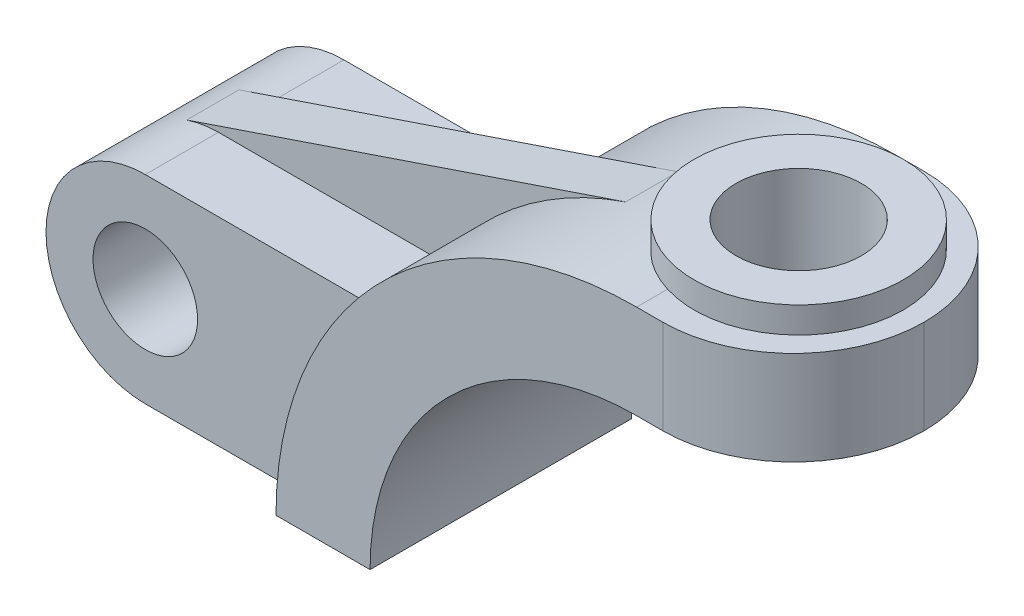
ISO-10303-21;
HEADER;
FILE_DESCRIPTION(('STEP AP214'),'2;1');
FILE_NAME('part.step','',(''),(''),'','','');
FILE_SCHEMA(('AUTOMOTIVE_DESIGN { 1 0 10303 214 1 1 1 1 }'));
ENDSEC;
DATA;
#1=APPLICATION_CONTEXT('core data for automotive mechanical design processes');
#2=APPLICATION_PROTOCOL_DEFINITION('international standard','automotive_design',2000,#1);
#3=PRODUCT_CONTEXT('',#1,'mechanical');
#4=PRODUCT('Part','Part','',(#3));
#5=PRODUCT_RELATED_PRODUCT_CATEGORY('part','',(#4));
#6=PRODUCT_DEFINITION_FORMATION('','',#4);
#7=PRODUCT_DEFINITION_CONTEXT('part definition',#1,'design');
#8=PRODUCT_DEFINITION('design','',#6,#7);
#9=PRODUCT_DEFINITION_SHAPE('','',#8);
#10=(LENGTH_UNIT() NAMED_UNIT(*) SI_UNIT(.MILLI.,.METRE.));
#11=(NAMED_UNIT(*) PLANE_ANGLE_UNIT() SI_UNIT($,.RADIAN.));
#12=(NAMED_UNIT(*) SI_UNIT($,.STERADIAN.) SOLID_ANGLE_UNIT());
#13=UNCERTAINTY_MEASURE_WITH_UNIT(LENGTH_MEASURE(1.E-05),#10,'distance_accuracy_value','');
#14=(GEOMETRIC_REPRESENTATION_CONTEXT(3) GLOBAL_UNCERTAINTY_ASSIGNED_CONTEXT((#13)) GLOBAL_UNIT_ASSIGNED_CONTEXT((#10,
#11,#12)) REPRESENTATION_CONTEXT('',''));
#15=CARTESIAN_POINT('',(0.,0.,0.));
#16=DIRECTION('',(0.,0.,1.));
#17=DIRECTION('',(1.,0.,0.));
#18=AXIS2_PLACEMENT_3D('',#15,#16,#17);
#19=CARTESIAN_POINT('',(0.,0.,-25.));
#20=DIRECTION('',(0.,0.,1.));
#21=DIRECTION('',(1.,0.,0.));
#22=AXIS2_PLACEMENT_3D('',#19,#20,#21);
#23=CYLINDRICAL_SURFACE('',#22,69.);
#24=DIRECTION('',(0.,0.,1.));
#25=VECTOR('',#24,1.);
#26=CARTESIAN_POINT('',(0.,69.,-25.));
#27=LINE('',#26,#25);
#28=CARTESIAN_POINT('',(0.,69.,19.0787840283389));
#29=VERTEX_POINT('',#28);
#30=CARTESIAN_POINT('',(0.,69.,25.));
#31=VERTEX_POINT('',#30);
#32=EDGE_CURVE('E203',#29,#31,#27,.T.);
#33=ORIENTED_EDGE('',*,*,#32,.F.);
#34=CARTESIAN_POINT('',(0.,69.,19.0787840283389));
#35=CARTESIAN_POINT('',(-0.265552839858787,69.0000019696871,18.9952724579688));
#36=CARTESIAN_POINT('',(-0.52932949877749,68.9984666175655,18.9062242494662));
#37=CARTESIAN_POINT('',(-1.05289731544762,68.9924626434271,18.7172141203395));
#38=CARTESIAN_POINT('',(-1.31268863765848,68.9879941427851,18.6172526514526));
#39=CARTESIAN_POINT('',(-2.08524848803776,68.9704057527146,18.3013162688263));
#40=CARTESIAN_POINT('',(-2.59142960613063,68.9531027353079,18.0692180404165));
#41=CARTESIAN_POINT('',(-3.58150813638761,68.9087659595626,17.5642540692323));
#42=CARTESIAN_POINT('',(-4.06544115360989,68.8817484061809,17.2914566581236));
#43=CARTESIAN_POINT('',(-4.77267358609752,68.8351472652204,16.8530856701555));
#44=CARTESIAN_POINT('',(-5.00532086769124,68.8185998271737,16.7020889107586));
#45=CARTESIAN_POINT('',(-5.46410264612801,68.783693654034,16.3905840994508));
#46=CARTESIAN_POINT('',(-5.69023552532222,68.7653344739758,16.2300737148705));
#47=CARTESIAN_POINT('',(-6.35798909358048,68.707899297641,15.7348986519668));
#48=CARTESIAN_POINT('',(-6.78926192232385,68.6664455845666,15.3864057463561));
#49=CARTESIAN_POINT('',(-7.62114489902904,68.5791014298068,14.6550724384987));
#50=CARTESIAN_POINT('',(-8.02175457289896,68.5332109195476,14.2722315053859));
#51=CARTESIAN_POINT('',(-8.59770640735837,68.4625219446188,13.6741968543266));
#52=CARTESIAN_POINT('',(-8.78557577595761,68.4386435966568,13.4708334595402));
#53=CARTESIAN_POINT('',(-9.15264612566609,68.3905206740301,13.0565650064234));
#54=CARTESIAN_POINT('',(-9.33184929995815,68.3662761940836,12.8456618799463));
#55=CARTESIAN_POINT('',(-9.85611683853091,68.2933487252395,12.202036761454));
#56=CARTESIAN_POINT('',(-10.1878688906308,68.2444680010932,11.7583682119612));
#57=CARTESIAN_POINT('',(-10.8187502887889,68.1473278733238,10.8372769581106));
#58=CARTESIAN_POINT('',(-11.1172342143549,68.0990928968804,10.3594108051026));
#59=CARTESIAN_POINT('',(-11.6729725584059,68.0060373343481,9.37992841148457));
#60=CARTESIAN_POINT('',(-11.930226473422,67.9612167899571,8.87831188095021));
#61=CARTESIAN_POINT('',(-12.4016266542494,67.8767783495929,7.85478252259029));
#62=CARTESIAN_POINT('',(-12.6157722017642,67.8371605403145,7.33286935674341));
#63=CARTESIAN_POINT('',(-12.9993398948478,67.7647053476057,6.27239954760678));
#64=CARTESIAN_POINT('',(-13.1687625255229,67.7318678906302,5.73384308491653));
#65=CARTESIAN_POINT('',(-13.460886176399,67.6744163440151,4.64643860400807));
#66=CARTESIAN_POINT('',(-13.5837988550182,67.6497650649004,4.0976494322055));
#67=CARTESIAN_POINT('',(-13.7830166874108,67.6094579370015,2.99134443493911));
#68=CARTESIAN_POINT('',(-13.8593219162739,67.5938020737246,2.43382862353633));
#69=CARTESIAN_POINT('',(-13.9646898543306,67.5721121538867,1.31424908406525));
#70=CARTESIAN_POINT('',(-13.9937598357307,67.5660766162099,0.752186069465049));
#71=CARTESIAN_POINT('',(-14.0044372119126,67.5638644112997,-0.372405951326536));
#72=CARTESIAN_POINT('',(-13.9860452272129,67.5676876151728,-0.934934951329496));
#73=CARTESIAN_POINT('',(-13.9027266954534,67.5848795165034,-2.0460011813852));
#74=CARTESIAN_POINT('',(-13.8386595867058,67.598071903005,-2.59460583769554));
#75=CARTESIAN_POINT('',(-13.6654496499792,67.6333001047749,-3.68435533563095));
#76=CARTESIAN_POINT('',(-13.5563073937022,67.6553358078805,-4.22550027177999));
#77=CARTESIAN_POINT('',(-13.2937882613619,67.7074078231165,-5.29658288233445));
#78=CARTESIAN_POINT('',(-13.1404090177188,67.7374445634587,-5.82651995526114));
#79=CARTESIAN_POINT('',(-12.7905744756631,67.8043722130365,-6.87153073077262));
#80=CARTESIAN_POINT('',(-12.5941187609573,67.8412631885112,-7.38660428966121));
#81=CARTESIAN_POINT('',(-12.1583777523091,67.9207120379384,-8.401176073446));
#82=CARTESIAN_POINT('',(-11.9188662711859,67.9632995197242,-8.90057484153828));
#83=CARTESIAN_POINT('',(-11.3994469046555,68.0523476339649,-9.87751756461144));
#84=CARTESIAN_POINT('',(-11.1195387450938,68.0988082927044,-10.3550613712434));
#85=CARTESIAN_POINT('',(-10.521101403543,68.1938279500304,-11.2853482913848));
#86=CARTESIAN_POINT('',(-10.2025618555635,68.2423875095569,-11.7380847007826));
#87=CARTESIAN_POINT('',(-9.69756356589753,68.3153436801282,-12.3960883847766));
#88=CARTESIAN_POINT('',(-9.52469214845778,68.3396828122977,-12.6119140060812));
#89=CARTESIAN_POINT('',(-9.1700945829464,68.3881671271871,-13.0362841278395));
#90=CARTESIAN_POINT('',(-8.98836614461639,68.4123122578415,-13.2448267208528));
#91=CARTESIAN_POINT('',(-8.423377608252,68.4849813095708,-13.866639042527));
#92=CARTESIAN_POINT('',(-8.02662297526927,68.5328110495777,-14.26786138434));
#93=CARTESIAN_POINT('',(-7.20038075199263,68.624537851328,-15.0355559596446));
#94=CARTESIAN_POINT('',(-6.77089324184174,68.6684349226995,-15.402028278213));
#95=CARTESIAN_POINT('',(-6.10458046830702,68.7297887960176,-15.9235260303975));
#96=CARTESIAN_POINT('',(-5.87885237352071,68.7494873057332,-16.0926198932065));
#97=CARTESIAN_POINT('',(-5.42041384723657,68.7871499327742,-16.4211340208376));
#98=CARTESIAN_POINT('',(-5.18770532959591,68.8051145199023,-16.5805569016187));
#99=CARTESIAN_POINT('',(-4.47975043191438,68.8560495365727,-17.0438499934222));
#100=CARTESIAN_POINT('',(-3.99448494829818,68.886079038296,-17.3328931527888));
#101=CARTESIAN_POINT('',(-2.93982924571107,68.9396041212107,-17.9019830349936));
#102=CARTESIAN_POINT('',(-2.36741917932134,68.9618473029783,-18.1765824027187));
#103=CARTESIAN_POINT('',(-1.49155450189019,68.9844955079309,-18.5466180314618));
#104=CARTESIAN_POINT('',(-1.19689306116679,68.9902585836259,-18.6629330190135));
#105=CARTESIAN_POINT('',(-0.602259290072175,68.9980128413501,-18.8814859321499));
#106=CARTESIAN_POINT('',(-0.302285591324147,69.0000030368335,-18.9837201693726));
#107=CARTESIAN_POINT('',(0.,69.,-19.0787840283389));
#108=B_SPLINE_CURVE_WITH_KNOTS('',3,(#34,#35,#36,#37,#38,#39,#40,#41,#42,#43,#44,#45,#46,#47,
#48,#49,#50,#51,#52,#53,#54,#55,#56,#57,#58,#59,#60,#61,#62,#63,#64,#65,#66,#67,#68,#69,#70,#71,
#72,#73,#74,#75,#76,#77,#78,#79,#80,#81,#82,#83,#84,#85,#86,#87,#88,#89,#90,#91,#92,#93,#94,#95,
#96,#97,#98,#99,#100,#101,#102,#103,#104,#105,#106,#107),.UNSPECIFIED.,.F.,.F.,(4,2,2,2,2,2,2,2,
2,2,2,2,2,2,2,2,2,2,2,2,2,2,2,2,2,2,2,2,2,2,2,2,2,2,2,2,4),(0.,0.834993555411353,
1.66995256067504,3.33915998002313,5.00559579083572,5.8389205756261,6.67245053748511,
8.3384629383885,10.0045010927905,10.8379562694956,11.6711994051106,13.3375572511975,
15.0320516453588,16.7265667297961,18.4211100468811,20.1156349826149,21.8023529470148,
23.4890681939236,25.1755237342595,26.8619572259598,28.5174683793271,30.1729585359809,
31.8285373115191,33.4841320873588,35.1486929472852,36.81326510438,38.4782849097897,
39.3108587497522,40.1436490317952,41.8403687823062,43.5370843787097,44.3850381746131,
45.2327615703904,46.9274859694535,48.8299804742,49.7801731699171,50.7306142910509),.UNSPECIFIED.);
#109=CARTESIAN_POINT('',(0.,69.,-19.0787840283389));
#110=VERTEX_POINT('',#109);
#111=EDGE_CURVE('E223',#29,#110,#108,.T.);
#112=ORIENTED_EDGE('',*,*,#111,.T.);
#113=CARTESIAN_POINT('',(0.,69.,-25.));
#114=VERTEX_POINT('',#113);
#115=EDGE_CURVE('E200',#114,#110,#27,.T.);
#116=ORIENTED_EDGE('',*,*,#115,.F.);
#117=CARTESIAN_POINT('',(0.,0.,-25.));
#118=DIRECTION('',(0.,0.,1.));
#119=DIRECTION('',(1.,0.,0.));
#120=AXIS2_PLACEMENT_3D('',#117,#118,#119);
#121=CIRCLE('',#120,69.);
#122=CARTESIAN_POINT('',(-69.,0.,-25.));
#123=VERTEX_POINT('',#122);
#124=EDGE_CURVE('E341',#114,#123,#121,.T.);
#125=ORIENTED_EDGE('',*,*,#124,.T.);
#126=DIRECTION('',(0.,0.,1.));
#127=VECTOR('',#126,1.);
#128=CARTESIAN_POINT('',(-69.,0.,-25.));
#129=LINE('',#128,#127);
#130=CARTESIAN_POINT('',(-69.,0.,-19.));
#131=VERTEX_POINT('',#130);
#132=EDGE_CURVE('E190',#123,#131,#129,.T.);
#133=ORIENTED_EDGE('',*,*,#132,.T.);
#134=CARTESIAN_POINT('',(0.,0.,-19.));
#135=DIRECTION('',(0.,0.,1.));
#136=DIRECTION('',(1.,0.,0.));
#137=AXIS2_PLACEMENT_3D('',#134,#135,#136);
#138=CIRCLE('',#137,69.);
#139=CARTESIAN_POINT('',(-57.6197952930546,37.9599682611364,-19.));
#140=VERTEX_POINT('',#139);
#141=EDGE_CURVE('E375',#140,#131,#138,.T.);
#142=ORIENTED_EDGE('',*,*,#141,.F.);
#143=DIRECTION('',(0.,0.,1.));
#144=VECTOR('',#143,1.);
#145=CARTESIAN_POINT('',(-57.6197952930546,37.9599682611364,-19.));
#146=LINE('',#145,#144);
#147=CARTESIAN_POINT('',(-57.6197952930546,37.9599682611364,-5.));
#148=VERTEX_POINT('',#147);
#149=EDGE_CURVE('E364',#140,#148,#146,.T.);
#150=ORIENTED_EDGE('',*,*,#149,.T.);
#151=CARTESIAN_POINT('',(0.,0.,-5.));
#152=DIRECTION('',(0.,0.,1.));
#153=DIRECTION('',(1.,0.,0.));
#154=AXIS2_PLACEMENT_3D('',#151,#152,#153);
#155=CIRCLE('',#154,69.);
#156=CARTESIAN_POINT('',(-22.1072732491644,65.3625922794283,-5.));
#157=VERTEX_POINT('',#156);
#158=EDGE_CURVE('E425',#157,#148,#155,.T.);
#159=ORIENTED_EDGE('',*,*,#158,.F.);
#160=DIRECTION('',(0.,0.,1.));
#161=VECTOR('',#160,1.);
#162=CARTESIAN_POINT('',(-22.1072732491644,65.3625922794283,-5.));
#163=LINE('',#162,#161);
#164=CARTESIAN_POINT('',(-22.1072732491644,65.3625922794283,5.));
#165=VERTEX_POINT('',#164);
#166=EDGE_CURVE('E415',#157,#165,#163,.T.);
#167=ORIENTED_EDGE('',*,*,#166,.T.);
#168=CARTESIAN_POINT('',(0.,0.,5.));
#169=DIRECTION('',(0.,0.,1.));
#170=DIRECTION('',(1.,0.,0.));
#171=AXIS2_PLACEMENT_3D('',#168,#169,#170);
#172=CIRCLE('',#171,69.);
#173=CARTESIAN_POINT('',(-57.6197952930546,37.9599682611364,5.));
#174=VERTEX_POINT('',#173);
#175=EDGE_CURVE('E440',#165,#174,#172,.T.);
#176=ORIENTED_EDGE('',*,*,#175,.T.);
#177=CARTESIAN_POINT('',(-57.6197952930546,37.9599682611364,19.));
#178=VERTEX_POINT('',#177);
#179=EDGE_CURVE('E362',#174,#178,#146,.T.);
#180=ORIENTED_EDGE('',*,*,#179,.T.);
#181=CARTESIAN_POINT('',(0.,0.,19.));
#182=DIRECTION('',(0.,0.,1.));
#183=DIRECTION('',(1.,0.,0.));
#184=AXIS2_PLACEMENT_3D('',#181,#182,#183);
#185=CIRCLE('',#184,69.);
#186=CARTESIAN_POINT('',(-69.,0.,19.));
#187=VERTEX_POINT('',#186);
#188=EDGE_CURVE('E387',#178,#187,#185,.T.);
#189=ORIENTED_EDGE('',*,*,#188,.T.);
#190=CARTESIAN_POINT('',(-69.,0.,25.));
#191=VERTEX_POINT('',#190);
#192=EDGE_CURVE('E199',#187,#191,#129,.T.);
#193=ORIENTED_EDGE('',*,*,#192,.T.);
#194=CARTESIAN_POINT('',(0.,0.,25.));
#195=DIRECTION('',(0.,0.,1.));
#196=DIRECTION('',(1.,0.,0.));
#197=AXIS2_PLACEMENT_3D('',#194,#195,#196);
#198=CIRCLE('',#197,69.);
#199=EDGE_CURVE('E330',#31,#191,#198,.T.);
#200=ORIENTED_EDGE('',*,*,#199,.F.);
#201=EDGE_LOOP('',(#33,#112,#116,#125,#133,#142,#150,#159,#167,#176,#180,#189,#193,#200));
#202=FACE_BOUND('',#201,.T.);
#203=ADVANCED_FACE('F46',(#202),#23,.T.);
#204=CARTESIAN_POINT('',(0.,37.9599682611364,-19.));
#205=DIRECTION('',(0.,-1.,0.));
#206=DIRECTION('',(0.,0.,-1.));
#207=AXIS2_PLACEMENT_3D('',#204,#205,#206);
#208=PLANE('',#207);
#209=DIRECTION('',(1.,0.,0.));
#210=VECTOR('',#209,1.);
#211=CARTESIAN_POINT('',(0.,37.9599682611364,-5.));
#212=LINE('',#211,#210);
#213=CARTESIAN_POINT('',(-100.,37.9599682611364,-5.));
#214=VERTEX_POINT('',#213);
#215=EDGE_CURVE('E429',#214,#148,#212,.T.);
#216=ORIENTED_EDGE('',*,*,#215,.T.);
#217=ORIENTED_EDGE('',*,*,#149,.F.);
#218=DIRECTION('',(1.,0.,0.));
#219=VECTOR('',#218,1.);
#220=CARTESIAN_POINT('',(0.,37.9599682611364,-19.));
#221=LINE('',#220,#219);
#222=CARTESIAN_POINT('',(-100.,37.9599682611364,-19.));
#223=VERTEX_POINT('',#222);
#224=EDGE_CURVE('E363',#223,#140,#221,.T.);
#225=ORIENTED_EDGE('',*,*,#224,.F.);
#226=DIRECTION('',(0.,0.,1.));
#227=VECTOR('',#226,1.);
#228=CARTESIAN_POINT('',(-100.,37.9599682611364,-19.));
#229=LINE('',#228,#227);
#230=EDGE_CURVE('E357',#223,#214,#229,.T.);
#231=ORIENTED_EDGE('',*,*,#230,.T.);
#232=EDGE_LOOP('',(#216,#217,#225,#231));
#233=FACE_BOUND('',#232,.T.);
#234=ADVANCED_FACE('F278',(#233),#208,.F.);
#235=CARTESIAN_POINT('',(-100.,18.9599682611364,-19.));
#236=DIRECTION('',(0.,0.,1.));
#237=DIRECTION('',(1.,0.,0.));
#238=AXIS2_PLACEMENT_3D('',#235,#236,#237);
#239=CYLINDRICAL_SURFACE('',#238,19.);
#240=DIRECTION('',(0.,0.,1.));
#241=VECTOR('',#240,1.);
#242=CARTESIAN_POINT('',(-106.087510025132,36.9583632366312,-5.));
#243=LINE('',#242,#241);
#244=CARTESIAN_POINT('',(-106.087510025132,36.9583632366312,-5.));
#245=VERTEX_POINT('',#244);
#246=CARTESIAN_POINT('',(-106.087510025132,36.9583632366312,5.));
#247=VERTEX_POINT('',#246);
#248=EDGE_CURVE('E414',#245,#247,#243,.T.);
#249=ORIENTED_EDGE('',*,*,#248,.F.);
#250=CARTESIAN_POINT('',(-100.,18.9599682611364,-5.));
#251=DIRECTION('',(0.,0.,1.));
#252=DIRECTION('',(1.,0.,0.));
#253=AXIS2_PLACEMENT_3D('',#250,#251,#252);
#254=CIRCLE('',#253,19.);
#255=EDGE_CURVE('E432',#214,#245,#254,.T.);
#256=ORIENTED_EDGE('',*,*,#255,.F.);
#257=ORIENTED_EDGE('',*,*,#230,.F.);
#258=CARTESIAN_POINT('',(-100.,18.9599682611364,-19.));
#259=DIRECTION('',(0.,0.,1.));
#260=DIRECTION('',(1.,0.,0.));
#261=AXIS2_PLACEMENT_3D('',#258,#259,#260);
#262=CIRCLE('',#261,19.);
#263=CARTESIAN_POINT('',(-100.,-0.0400317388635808,-19.));
#264=VERTEX_POINT('',#263);
#265=EDGE_CURVE('E398',#223,#264,#262,.T.);
#266=ORIENTED_EDGE('',*,*,#265,.T.);
#267=DIRECTION('',(0.,0.,1.));
#268=VECTOR('',#267,1.);
#269=CARTESIAN_POINT('',(-100.,-0.0400317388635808,-19.));
#270=LINE('',#269,#268);
#271=CARTESIAN_POINT('',(-100.,-0.0400317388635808,19.));
#272=VERTEX_POINT('',#271);
#273=EDGE_CURVE('E394',#264,#272,#270,.T.);
#274=ORIENTED_EDGE('',*,*,#273,.T.);
#275=CARTESIAN_POINT('',(-100.,18.9599682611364,19.));
#276=DIRECTION('',(0.,0.,1.));
#277=DIRECTION('',(1.,0.,0.));
#278=AXIS2_PLACEMENT_3D('',#275,#276,#277);
#279=CIRCLE('',#278,19.);
#280=CARTESIAN_POINT('',(-100.,37.9599682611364,19.));
#281=VERTEX_POINT('',#280);
#282=EDGE_CURVE('E406',#281,#272,#279,.T.);
#283=ORIENTED_EDGE('',*,*,#282,.F.);
#284=CARTESIAN_POINT('',(-100.,37.9599682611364,5.));
#285=VERTEX_POINT('',#284);
#286=EDGE_CURVE('E368',#285,#281,#229,.T.);
#287=ORIENTED_EDGE('',*,*,#286,.F.);
#288=CARTESIAN_POINT('',(-100.,18.9599682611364,5.));
#289=DIRECTION('',(0.,0.,1.));
#290=DIRECTION('',(1.,0.,0.));
#291=AXIS2_PLACEMENT_3D('',#288,#289,#290);
#292=CIRCLE('',#291,19.);
#293=EDGE_CURVE('E447',#285,#247,#292,.T.);
#294=ORIENTED_EDGE('',*,*,#293,.T.);
#295=EDGE_LOOP('',(#249,#256,#257,#266,#274,#283,#287,#294));
#296=FACE_BOUND('',#295,.T.);
#297=ADVANCED_FACE('F275',(#296),#239,.T.);
#298=CARTESIAN_POINT('',(0.,0.,-25.));
#299=DIRECTION('',(0.,0.,1.));
#300=DIRECTION('',(1.,0.,0.));
#301=AXIS2_PLACEMENT_3D('',#298,#299,#300);
#302=CYLINDRICAL_SURFACE('',#301,51.);
#303=DIRECTION('',(0.,0.,1.));
#304=VECTOR('',#303,1.);
#305=CARTESIAN_POINT('',(0.,51.,-25.));
#306=LINE('',#305,#304);
#307=CARTESIAN_POINT('',(0.,51.,-25.));
#308=VERTEX_POINT('',#307);
#309=CARTESIAN_POINT('',(0.,51.,-10.3923048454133));
#310=VERTEX_POINT('',#309);
#311=EDGE_CURVE('E176',#308,#310,#306,.T.);
#312=ORIENTED_EDGE('',*,*,#311,.T.);
#313=CARTESIAN_POINT('',(0.,51.,-10.3923048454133));
#314=CARTESIAN_POINT('',(-0.291487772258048,51.0000140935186,-10.2240581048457));
#315=CARTESIAN_POINT('',(-0.575843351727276,50.9975011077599,-10.0434940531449));
#316=CARTESIAN_POINT('',(-1.12831695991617,50.9882618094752,-9.65919587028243));
#317=CARTESIAN_POINT('',(-1.3964370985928,50.9815360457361,-9.45546475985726));
#318=CARTESIAN_POINT('',(-1.9143010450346,50.9647194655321,-9.02645336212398));
#319=CARTESIAN_POINT('',(-2.16406182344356,50.9546318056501,-8.80119342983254));
#320=CARTESIAN_POINT('',(-2.64374959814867,50.9319961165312,-8.33057458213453));
#321=CARTESIAN_POINT('',(-2.8736763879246,50.9194480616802,-8.08521545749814));
#322=CARTESIAN_POINT('',(-3.31213102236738,50.8928094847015,-7.57608745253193));
#323=CARTESIAN_POINT('',(-3.52065577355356,50.8787187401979,-7.31231592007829));
#324=CARTESIAN_POINT('',(-3.91483039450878,50.8499082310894,-6.76823369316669));
#325=CARTESIAN_POINT('',(-4.10048020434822,50.8351884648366,-6.48792295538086));
#326=CARTESIAN_POINT('',(-4.44760159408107,50.8059955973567,-5.91273567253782));
#327=CARTESIAN_POINT('',(-4.60907554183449,50.791522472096,-5.61786055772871));
#328=CARTESIAN_POINT('',(-4.90673867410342,50.7636314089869,-5.01556497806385));
#329=CARTESIAN_POINT('',(-5.04292787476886,50.7502134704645,-4.70814452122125));
#330=CARTESIAN_POINT('',(-5.28967983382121,50.7250900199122,-4.08131711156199));
#331=CARTESIAN_POINT('',(-5.40010966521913,50.7133935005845,-3.76185745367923));
#332=CARTESIAN_POINT('',(-5.59365308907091,50.6924109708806,-3.1146877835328));
#333=CARTESIAN_POINT('',(-5.67676655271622,50.6831249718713,-2.78697773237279));
#334=CARTESIAN_POINT('',(-5.81507033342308,50.6674432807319,-2.1256182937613));
#335=CARTESIAN_POINT('',(-5.87025822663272,50.6610478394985,-1.79196839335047));
#336=CARTESIAN_POINT('',(-5.95228782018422,50.6514755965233,-1.12115704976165));
#337=CARTESIAN_POINT('',(-5.97912970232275,50.6482987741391,-0.783995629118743));
#338=CARTESIAN_POINT('',(-6.00419487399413,50.6453334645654,-0.110513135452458));
#339=CARTESIAN_POINT('',(-6.00257967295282,50.6455258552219,0.225801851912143));
#340=CARTESIAN_POINT('',(-5.9711374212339,50.6492425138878,0.897091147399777));
#341=CARTESIAN_POINT('',(-5.94131045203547,50.6527667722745,1.23206545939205));
#342=CARTESIAN_POINT('',(-5.85367185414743,50.6629693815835,1.89824076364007));
#343=CARTESIAN_POINT('',(-5.79586371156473,50.6696473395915,2.22944222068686));
#344=CARTESIAN_POINT('',(-5.65269018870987,50.6858192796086,2.88576256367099));
#345=CARTESIAN_POINT('',(-5.56732483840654,50.6953132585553,3.21088145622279));
#346=CARTESIAN_POINT('',(-5.36983744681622,50.7166114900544,3.85216226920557));
#347=CARTESIAN_POINT('',(-5.25776421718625,50.7284115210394,4.16833936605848));
#348=CARTESIAN_POINT('',(-5.00757870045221,50.7537186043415,4.79014849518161));
#349=CARTESIAN_POINT('',(-4.86946621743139,50.7672256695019,5.09578044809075));
#350=CARTESIAN_POINT('',(-4.56809736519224,50.7952299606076,5.6945331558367));
#351=CARTESIAN_POINT('',(-4.40482821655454,50.8097276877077,5.98764745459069));
#352=CARTESIAN_POINT('',(-4.05433783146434,50.8388950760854,6.55916587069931));
#353=CARTESIAN_POINT('',(-3.86711730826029,50.8535647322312,6.83757042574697));
#354=CARTESIAN_POINT('',(-3.46853589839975,50.8823099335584,7.37976129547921));
#355=CARTESIAN_POINT('',(-3.25700615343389,50.8963802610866,7.64342377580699));
#356=CARTESIAN_POINT('',(-2.81241837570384,50.9228815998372,8.15201535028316));
#357=CARTESIAN_POINT('',(-2.57936063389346,50.9353126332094,8.39694469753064));
#358=CARTESIAN_POINT('',(-2.09376842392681,50.957581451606,8.86592782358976));
#359=CARTESIAN_POINT('',(-1.84126728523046,50.9674235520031,9.09001593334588));
#360=CARTESIAN_POINT('',(-1.31832433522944,50.9836283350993,9.51607935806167));
#361=CARTESIAN_POINT('',(-1.04789298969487,50.9899930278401,9.71806739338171));
#362=CARTESIAN_POINT('',(-0.644276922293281,50.9960843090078,9.99382848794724));
#363=CARTESIAN_POINT('',(-0.517448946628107,50.9975364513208,10.0769967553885));
#364=CARTESIAN_POINT('',(-0.260894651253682,50.9994938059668,10.2383652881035));
#365=CARTESIAN_POINT('',(-0.13117232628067,51.0000002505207,10.3165718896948));
#366=CARTESIAN_POINT('',(0.,51.,10.3923048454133));
#367=B_SPLINE_CURVE_WITH_KNOTS('',3,(#313,#314,#315,#316,#317,#318,#319,#320,#321,#322,#323,
#324,#325,#326,#327,#328,#329,#330,#331,#332,#333,#334,#335,#336,#337,#338,#339,#340,#341,#342,
#343,#344,#345,#346,#347,#348,#349,#350,#351,#352,#353,#354,#355,#356,#357,#358,#359,#360,#361,
#362,#363,#364,#365,#366),.UNSPECIFIED.,.F.,.F.,(4,2,2,2,2,2,2,2,2,2,2,2,2,2,2,2,2,2,2,2,2,2,2,
2,2,2,4),(0.,1.00934288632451,2.01855431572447,3.02682082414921,4.03509782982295,
5.04352036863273,6.05194554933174,7.06027189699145,8.06859760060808,9.08201685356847,
10.0954408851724,11.1089528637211,12.1224583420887,13.1302134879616,14.1379657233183,
15.1455924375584,16.1532180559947,17.1590160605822,18.164821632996,19.1711398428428,
20.1774280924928,21.1911850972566,22.2049284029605,23.2169710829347,24.2284281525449,
24.6833509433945,25.1376805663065),.UNSPECIFIED.);
#368=CARTESIAN_POINT('',(0.,51.,10.3923048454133));
#369=VERTEX_POINT('',#368);
#370=EDGE_CURVE('E61',#310,#369,#367,.T.);
#371=ORIENTED_EDGE('',*,*,#370,.T.);
#372=CARTESIAN_POINT('',(0.,51.,25.));
#373=VERTEX_POINT('',#372);
#374=EDGE_CURVE('E173',#369,#373,#306,.T.);
#375=ORIENTED_EDGE('',*,*,#374,.T.);
#376=CARTESIAN_POINT('',(0.,0.,25.));
#377=DIRECTION('',(0.,0.,1.));
#378=DIRECTION('',(1.,0.,0.));
#379=AXIS2_PLACEMENT_3D('',#376,#377,#378);
#380=CIRCLE('',#379,51.);
#381=CARTESIAN_POINT('',(-51.,0.,25.));
#382=VERTEX_POINT('',#381);
#383=EDGE_CURVE('E346',#373,#382,#380,.T.);
#384=ORIENTED_EDGE('',*,*,#383,.T.);
#385=DIRECTION('',(0.,0.,1.));
#386=VECTOR('',#385,1.);
#387=CARTESIAN_POINT('',(-51.,0.,-25.));
#388=LINE('',#387,#386);
#389=CARTESIAN_POINT('',(-51.,0.,-25.));
#390=VERTEX_POINT('',#389);
#391=EDGE_CURVE('E185',#390,#382,#388,.T.);
#392=ORIENTED_EDGE('',*,*,#391,.F.);
#393=CARTESIAN_POINT('',(0.,0.,-25.));
#394=DIRECTION('',(0.,0.,1.));
#395=DIRECTION('',(1.,0.,0.));
#396=AXIS2_PLACEMENT_3D('',#393,#394,#395);
#397=CIRCLE('',#396,51.);
#398=EDGE_CURVE('E193',#308,#390,#397,.T.);
#399=ORIENTED_EDGE('',*,*,#398,.F.);
#400=EDGE_LOOP('',(#312,#371,#375,#384,#392,#399));
#401=FACE_BOUND('',#400,.T.);
#402=ADVANCED_FACE('F171',(#401),#302,.F.);
#403=CARTESIAN_POINT('',(0.,0.,-25.));
#404=DIRECTION('',(0.,1.,0.));
#405=DIRECTION('',(-1.,0.,0.));
#406=AXIS2_PLACEMENT_3D('',#403,#404,#405);
#407=PLANE('',#406);
#408=ORIENTED_EDGE('',*,*,#391,.T.);
#409=DIRECTION('',(-1.,0.,0.));
#410=VECTOR('',#409,1.);
#411=CARTESIAN_POINT('',(0.,0.,25.));
#412=LINE('',#411,#410);
#413=EDGE_CURVE('E351',#382,#191,#412,.T.);
#414=ORIENTED_EDGE('',*,*,#413,.T.);
#415=ORIENTED_EDGE('',*,*,#192,.F.);
#416=DIRECTION('',(0.,0.,1.));
#417=VECTOR('',#416,1.);
#418=CARTESIAN_POINT('',(-69.,0.,-19.));
#419=LINE('',#418,#417);
#420=EDGE_CURVE('E358',#131,#187,#419,.T.);
#421=ORIENTED_EDGE('',*,*,#420,.F.);
#422=ORIENTED_EDGE('',*,*,#132,.F.);
#423=DIRECTION('',(-1.,0.,0.));
#424=VECTOR('',#423,1.);
#425=CARTESIAN_POINT('',(0.,0.,-25.));
#426=LINE('',#425,#424);
#427=EDGE_CURVE('E338',#390,#123,#426,.T.);
#428=ORIENTED_EDGE('',*,*,#427,.F.);
#429=EDGE_LOOP('',(#408,#414,#415,#421,#422,#428));
#430=FACE_BOUND('',#429,.T.);
#431=ADVANCED_FACE('F306',(#430),#407,.F.);
#432=CARTESIAN_POINT('',(0.,0.,-25.));
#433=DIRECTION('',(0.,0.,1.));
#434=DIRECTION('',(1.,0.,0.));
#435=AXIS2_PLACEMENT_3D('',#432,#433,#434);
#436=PLANE('',#435);
#437=DIRECTION('',(1.,0.,0.));
#438=VECTOR('',#437,1.);
#439=CARTESIAN_POINT('',(0.,69.,-25.));
#440=LINE('',#439,#438);
#441=CARTESIAN_POINT('',(5.,69.,-25.));
#442=VERTEX_POINT('',#441);
#443=EDGE_CURVE('E450',#114,#442,#440,.T.);
#444=ORIENTED_EDGE('',*,*,#443,.T.);
#445=DIRECTION('',(0.,-1.,0.));
#446=VECTOR('',#445,1.);
#447=CARTESIAN_POINT('',(5.,0.,-25.));
#448=LINE('',#447,#446);
#449=CARTESIAN_POINT('',(5.,51.,-25.));
#450=VERTEX_POINT('',#449);
#451=EDGE_CURVE('E189',#442,#450,#448,.T.);
#452=ORIENTED_EDGE('',*,*,#451,.T.);
#453=DIRECTION('',(-1.,0.,0.));
#454=VECTOR('',#453,1.);
#455=CARTESIAN_POINT('',(0.,51.,-25.));
#456=LINE('',#455,#454);
#457=EDGE_CURVE('E454',#450,#308,#456,.T.);
#458=ORIENTED_EDGE('',*,*,#457,.T.);
#459=ORIENTED_EDGE('',*,*,#398,.T.);
#460=ORIENTED_EDGE('',*,*,#427,.T.);
#461=ORIENTED_EDGE('',*,*,#124,.F.);
#462=EDGE_LOOP('',(#444,#452,#458,#459,#460,#461));
#463=FACE_BOUND('',#462,.T.);
#464=ADVANCED_FACE('F302',(#463),#436,.F.);
#465=CARTESIAN_POINT('',(0.,0.,25.));
#466=DIRECTION('',(0.,0.,1.));
#467=DIRECTION('',(1.,0.,0.));
#468=AXIS2_PLACEMENT_3D('',#465,#466,#467);
#469=PLANE('',#468);
#470=DIRECTION('',(-1.,0.,0.));
#471=VECTOR('',#470,1.);
#472=CARTESIAN_POINT('',(0.,51.,25.));
#473=LINE('',#472,#471);
#474=CARTESIAN_POINT('',(5.,51.,25.));
#475=VERTEX_POINT('',#474);
#476=EDGE_CURVE('E182',#475,#373,#473,.T.);
#477=ORIENTED_EDGE('',*,*,#476,.F.);
#478=DIRECTION('',(0.,-1.,0.));
#479=VECTOR('',#478,1.);
#480=CARTESIAN_POINT('',(5.,69.,25.));
#481=LINE('',#480,#479);
#482=CARTESIAN_POINT('',(5.,69.,25.));
#483=VERTEX_POINT('',#482);
#484=EDGE_CURVE('E55',#475,#483,#481,.F.);
#485=ORIENTED_EDGE('',*,*,#484,.T.);
#486=DIRECTION('',(1.,0.,0.));
#487=VECTOR('',#486,1.);
#488=CARTESIAN_POINT('',(0.,69.,25.));
#489=LINE('',#488,#487);
#490=EDGE_CURVE('E229',#31,#483,#489,.T.);
#491=ORIENTED_EDGE('',*,*,#490,.F.);
#492=ORIENTED_EDGE('',*,*,#199,.T.);
#493=ORIENTED_EDGE('',*,*,#413,.F.);
#494=ORIENTED_EDGE('',*,*,#383,.F.);
#495=EDGE_LOOP('',(#477,#485,#491,#492,#493,#494));
#496=FACE_BOUND('',#495,.T.);
#497=ADVANCED_FACE('F295',(#496),#469,.T.);
#498=ORIENTED_EDGE('',*,*,#179,.F.);
#499=DIRECTION('',(1.,0.,0.));
#500=VECTOR('',#499,1.);
#501=CARTESIAN_POINT('',(0.,37.9599682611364,5.));
#502=LINE('',#501,#500);
#503=EDGE_CURVE('E443',#285,#174,#502,.T.);
#504=ORIENTED_EDGE('',*,*,#503,.F.);
#505=ORIENTED_EDGE('',*,*,#286,.T.);
#506=DIRECTION('',(1.,0.,0.));
#507=VECTOR('',#506,1.);
#508=CARTESIAN_POINT('',(0.,37.9599682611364,19.));
#509=LINE('',#508,#507);
#510=EDGE_CURVE('E383',#281,#178,#509,.T.);
#511=ORIENTED_EDGE('',*,*,#510,.T.);
#512=EDGE_LOOP('',(#498,#504,#505,#511));
#513=FACE_BOUND('',#512,.T.);
#514=ADVANCED_FACE('F292',(#513),#208,.F.);
#515=CARTESIAN_POINT('',(-0.000115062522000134,0.0891027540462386,-19.));
#516=DIRECTION('',(0.00129134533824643,-0.999999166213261,0.));
#517=DIRECTION('',(0.999999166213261,0.00129134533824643,0.));
#518=AXIS2_PLACEMENT_3D('',#515,#516,#517);
#519=PLANE('',#518);
#520=ORIENTED_EDGE('',*,*,#420,.T.);
#521=DIRECTION('',(0.999999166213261,0.00129134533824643,0.));
#522=VECTOR('',#521,1.);
#523=CARTESIAN_POINT('',(-0.000115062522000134,0.0891027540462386,19.));
#524=LINE('',#523,#522);
#525=EDGE_CURVE('E390',#272,#187,#524,.T.);
#526=ORIENTED_EDGE('',*,*,#525,.F.);
#527=ORIENTED_EDGE('',*,*,#273,.F.);
#528=DIRECTION('',(0.999999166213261,0.00129134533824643,0.));
#529=VECTOR('',#528,1.);
#530=CARTESIAN_POINT('',(-0.000115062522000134,0.0891027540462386,-19.));
#531=LINE('',#530,#529);
#532=EDGE_CURVE('E379',#264,#131,#531,.T.);
#533=ORIENTED_EDGE('',*,*,#532,.T.);
#534=EDGE_LOOP('',(#520,#526,#527,#533));
#535=FACE_BOUND('',#534,.T.);
#536=ADVANCED_FACE('F290',(#535),#519,.T.);
#537=CARTESIAN_POINT('',(0.,0.,-19.));
#538=DIRECTION('',(0.,0.,1.));
#539=DIRECTION('',(1.,0.,0.));
#540=AXIS2_PLACEMENT_3D('',#537,#538,#539);
#541=PLANE('',#540);
#542=ORIENTED_EDGE('',*,*,#532,.F.);
#543=ORIENTED_EDGE('',*,*,#265,.F.);
#544=ORIENTED_EDGE('',*,*,#224,.T.);
#545=ORIENTED_EDGE('',*,*,#141,.T.);
#546=EDGE_LOOP('',(#542,#543,#544,#545));
#547=FACE_BOUND('',#546,.T.);
#548=CARTESIAN_POINT('',(-100.,18.9599682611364,-19.));
#549=DIRECTION('',(0.,0.,1.));
#550=DIRECTION('',(1.,0.,0.));
#551=AXIS2_PLACEMENT_3D('',#548,#549,#550);
#552=CIRCLE('',#551,9.99999999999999);
#553=CARTESIAN_POINT('',(-90.,18.9599682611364,-19.));
#554=VERTEX_POINT('',#553);
#555=EDGE_CURVE('E402',#554,#554,#552,.T.);
#556=ORIENTED_EDGE('',*,*,#555,.T.);
#557=EDGE_LOOP('',(#556));
#558=FACE_BOUND('',#557,.T.);
#559=ADVANCED_FACE('F286',(#547,#558),#541,.F.);
#560=CARTESIAN_POINT('',(0.,0.,19.));
#561=DIRECTION('',(0.,0.,1.));
#562=DIRECTION('',(1.,0.,0.));
#563=AXIS2_PLACEMENT_3D('',#560,#561,#562);
#564=PLANE('',#563);
#565=ORIENTED_EDGE('',*,*,#510,.F.);
#566=ORIENTED_EDGE('',*,*,#282,.T.);
#567=ORIENTED_EDGE('',*,*,#525,.T.);
#568=ORIENTED_EDGE('',*,*,#188,.F.);
#569=EDGE_LOOP('',(#565,#566,#567,#568));
#570=FACE_BOUND('',#569,.T.);
#571=CARTESIAN_POINT('',(-100.,18.9599682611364,19.));
#572=DIRECTION('',(0.,0.,1.));
#573=DIRECTION('',(1.,0.,0.));
#574=AXIS2_PLACEMENT_3D('',#571,#572,#573);
#575=CIRCLE('',#574,9.99999999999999);
#576=CARTESIAN_POINT('',(-90.,18.9599682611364,19.));
#577=VERTEX_POINT('',#576);
#578=EDGE_CURVE('E410',#577,#577,#575,.T.);
#579=ORIENTED_EDGE('',*,*,#578,.F.);
#580=EDGE_LOOP('',(#579));
#581=FACE_BOUND('',#580,.T.);
#582=ADVANCED_FACE('F282',(#570,#581),#564,.T.);
#583=CARTESIAN_POINT('',(-100.,18.9599682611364,-19.));
#584=DIRECTION('',(0.,0.,1.));
#585=DIRECTION('',(1.,0.,0.));
#586=AXIS2_PLACEMENT_3D('',#583,#584,#585);
#587=CYLINDRICAL_SURFACE('',#586,9.99999999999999);
#588=ORIENTED_EDGE('',*,*,#555,.F.);
#589=EDGE_LOOP('',(#588));
#590=FACE_BOUND('',#589,.T.);
#591=ORIENTED_EDGE('',*,*,#578,.T.);
#592=EDGE_LOOP('',(#591));
#593=FACE_BOUND('',#592,.T.);
#594=ADVANCED_FACE('F273',(#590,#593),#587,.F.);
#595=CARTESIAN_POINT('',(-22.1072732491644,65.3625922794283,-5.));
#596=DIRECTION('',(-0.320395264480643,0.947283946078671,0.));
#597=DIRECTION('',(-0.947283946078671,-0.320395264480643,0.));
#598=AXIS2_PLACEMENT_3D('',#595,#596,#597);
#599=PLANE('',#598);
#600=ORIENTED_EDGE('',*,*,#248,.T.);
#601=DIRECTION('',(-0.947283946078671,-0.320395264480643,0.));
#602=VECTOR('',#601,1.);
#603=CARTESIAN_POINT('',(-22.1072732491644,65.3625922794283,5.));
#604=LINE('',#603,#602);
#605=EDGE_CURVE('E436',#165,#247,#604,.T.);
#606=ORIENTED_EDGE('',*,*,#605,.F.);
#607=ORIENTED_EDGE('',*,*,#166,.F.);
#608=DIRECTION('',(-0.947283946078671,-0.320395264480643,0.));
#609=VECTOR('',#608,1.);
#610=CARTESIAN_POINT('',(-22.1072732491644,65.3625922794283,-5.));
#611=LINE('',#610,#609);
#612=EDGE_CURVE('E418',#157,#245,#611,.T.);
#613=ORIENTED_EDGE('',*,*,#612,.T.);
#614=EDGE_LOOP('',(#600,#606,#607,#613));
#615=FACE_BOUND('',#614,.T.);
#616=ADVANCED_FACE('F269',(#615),#599,.T.);
#617=CARTESIAN_POINT('',(0.,0.,-5.));
#618=DIRECTION('',(0.,0.,1.));
#619=DIRECTION('',(1.,0.,0.));
#620=AXIS2_PLACEMENT_3D('',#617,#618,#619);
#621=PLANE('',#620);
#622=ORIENTED_EDGE('',*,*,#255,.T.);
#623=ORIENTED_EDGE('',*,*,#612,.F.);
#624=ORIENTED_EDGE('',*,*,#158,.T.);
#625=ORIENTED_EDGE('',*,*,#215,.F.);
#626=EDGE_LOOP('',(#622,#623,#624,#625));
#627=FACE_BOUND('',#626,.T.);
#628=ADVANCED_FACE('F265',(#627),#621,.F.);
#629=CARTESIAN_POINT('',(0.,0.,5.));
#630=DIRECTION('',(0.,0.,1.));
#631=DIRECTION('',(1.,0.,0.));
#632=AXIS2_PLACEMENT_3D('',#629,#630,#631);
#633=PLANE('',#632);
#634=ORIENTED_EDGE('',*,*,#293,.F.);
#635=ORIENTED_EDGE('',*,*,#503,.T.);
#636=ORIENTED_EDGE('',*,*,#175,.F.);
#637=ORIENTED_EDGE('',*,*,#605,.T.);
#638=EDGE_LOOP('',(#634,#635,#636,#637));
#639=FACE_BOUND('',#638,.T.);
#640=ADVANCED_FACE('F262',(#639),#633,.T.);
#641=CARTESIAN_POINT('',(0.,51.,-25.));
#642=DIRECTION('',(0.,1.,0.));
#643=DIRECTION('',(0.,0.,1.));
#644=AXIS2_PLACEMENT_3D('',#641,#642,#643);
#645=PLANE('',#644);
#646=ORIENTED_EDGE('',*,*,#374,.F.);
#647=CARTESIAN_POINT('',(6.,51.,0.));
#648=DIRECTION('',(0.,1.,0.));
#649=DIRECTION('',(0.,0.,1.));
#650=AXIS2_PLACEMENT_3D('',#647,#648,#649);
#651=CIRCLE('',#650,12.);
#652=EDGE_CURVE('E161',#369,#310,#651,.T.);
#653=ORIENTED_EDGE('',*,*,#652,.T.);
#654=ORIENTED_EDGE('',*,*,#311,.F.);
#655=ORIENTED_EDGE('',*,*,#457,.F.);
#656=CARTESIAN_POINT('',(5.,51.,0.));
#657=DIRECTION('',(0.,1.,0.));
#658=DIRECTION('',(0.,0.,1.));
#659=AXIS2_PLACEMENT_3D('',#656,#657,#658);
#660=CIRCLE('',#659,25.);
#661=CARTESIAN_POINT('',(30.,51.,0.));
#662=VERTEX_POINT('',#661);
#663=EDGE_CURVE('E210',#450,#662,#660,.F.);
#664=ORIENTED_EDGE('',*,*,#663,.T.);
#665=CARTESIAN_POINT('',(5.,51.,0.));
#666=DIRECTION('',(0.,1.,0.));
#667=DIRECTION('',(0.,0.,1.));
#668=AXIS2_PLACEMENT_3D('',#665,#666,#667);
#669=CIRCLE('',#668,25.);
#670=EDGE_CURVE('E207',#662,#475,#669,.F.);
#671=ORIENTED_EDGE('',*,*,#670,.T.);
#672=ORIENTED_EDGE('',*,*,#476,.T.);
#673=EDGE_LOOP('',(#646,#653,#654,#655,#664,#671,#672));
#674=FACE_BOUND('',#673,.T.);
#675=ADVANCED_FACE('F180',(#674),#645,.F.);
#676=CARTESIAN_POINT('',(0.,69.,-25.));
#677=DIRECTION('',(0.,-1.,0.));
#678=DIRECTION('',(0.,0.,-1.));
#679=AXIS2_PLACEMENT_3D('',#676,#677,#678);
#680=PLANE('',#679);
#681=CARTESIAN_POINT('',(6.,69.,0.));
#682=DIRECTION('',(0.,-1.,0.));
#683=DIRECTION('',(0.,0.,-1.));
#684=AXIS2_PLACEMENT_3D('',#681,#682,#683);
#685=CIRCLE('',#684,20.);
#686=EDGE_CURVE('E11',#29,#110,#685,.F.);
#687=ORIENTED_EDGE('',*,*,#686,.F.);
#688=ORIENTED_EDGE('',*,*,#32,.T.);
#689=ORIENTED_EDGE('',*,*,#490,.T.);
#690=CARTESIAN_POINT('',(5.,69.,0.));
#691=DIRECTION('',(0.,-1.,0.));
#692=DIRECTION('',(0.,0.,-1.));
#693=AXIS2_PLACEMENT_3D('',#690,#691,#692);
#694=CIRCLE('',#693,25.);
#695=CARTESIAN_POINT('',(30.,69.,0.));
#696=VERTEX_POINT('',#695);
#697=EDGE_CURVE('E213',#483,#696,#694,.F.);
#698=ORIENTED_EDGE('',*,*,#697,.T.);
#699=CARTESIAN_POINT('',(5.,69.,0.));
#700=DIRECTION('',(0.,-1.,0.));
#701=DIRECTION('',(0.,0.,-1.));
#702=AXIS2_PLACEMENT_3D('',#699,#700,#701);
#703=CIRCLE('',#702,25.);
#704=EDGE_CURVE('E216',#696,#442,#703,.F.);
#705=ORIENTED_EDGE('',*,*,#704,.T.);
#706=ORIENTED_EDGE('',*,*,#443,.F.);
#707=ORIENTED_EDGE('',*,*,#115,.T.);
#708=EDGE_LOOP('',(#687,#688,#689,#698,#705,#706,#707));
#709=FACE_BOUND('',#708,.T.);
#710=ADVANCED_FACE('F257',(#709),#680,.F.);
#711=CARTESIAN_POINT('',(5.,0.,0.));
#712=DIRECTION('',(0.,1.,0.));
#713=DIRECTION('',(0.,0.,1.));
#714=AXIS2_PLACEMENT_3D('',#711,#712,#713);
#715=CYLINDRICAL_SURFACE('',#714,25.);
#716=DIRECTION('',(0.,-1.,0.));
#717=VECTOR('',#716,1.);
#718=CARTESIAN_POINT('',(30.,51.,0.));
#719=LINE('',#718,#717);
#720=EDGE_CURVE('E220',#696,#662,#719,.T.);
#721=ORIENTED_EDGE('',*,*,#720,.F.);
#722=ORIENTED_EDGE('',*,*,#697,.F.);
#723=ORIENTED_EDGE('',*,*,#484,.F.);
#724=ORIENTED_EDGE('',*,*,#670,.F.);
#725=EDGE_LOOP('',(#721,#722,#723,#724));
#726=FACE_BOUND('',#725,.T.);
#727=ADVANCED_FACE('F48',(#726),#715,.T.);
#728=CARTESIAN_POINT('',(5.,0.,0.));
#729=DIRECTION('',(0.,-1.,0.));
#730=DIRECTION('',(0.,0.,-1.));
#731=AXIS2_PLACEMENT_3D('',#728,#729,#730);
#732=CYLINDRICAL_SURFACE('',#731,25.);
#733=ORIENTED_EDGE('',*,*,#704,.F.);
#734=ORIENTED_EDGE('',*,*,#720,.T.);
#735=ORIENTED_EDGE('',*,*,#663,.F.);
#736=ORIENTED_EDGE('',*,*,#451,.F.);
#737=EDGE_LOOP('',(#733,#734,#735,#736));
#738=FACE_BOUND('',#737,.T.);
#739=ADVANCED_FACE('F254',(#738),#732,.T.);
#740=CARTESIAN_POINT('',(6.,54.,0.));
#741=DIRECTION('',(0.,1.,0.));
#742=DIRECTION('',(0.,0.,1.));
#743=AXIS2_PLACEMENT_3D('',#740,#741,#742);
#744=CYLINDRICAL_SURFACE('',#743,20.);
#745=ORIENTED_EDGE('',*,*,#111,.F.);
#746=ORIENTED_EDGE('',*,*,#686,.T.);
#747=EDGE_LOOP('',(#745,#746));
#748=FACE_BOUND('',#747,.T.);
#749=CARTESIAN_POINT('',(6.,74.,0.));
#750=DIRECTION('',(0.,-1.,0.));
#751=DIRECTION('',(0.,0.,-1.));
#752=AXIS2_PLACEMENT_3D('',#749,#750,#751);
#753=CIRCLE('',#752,20.);
#754=CARTESIAN_POINT('',(6.,74.,-20.));
#755=VERTEX_POINT('',#754);
#756=EDGE_CURVE('E178',#755,#755,#753,.T.);
#757=ORIENTED_EDGE('',*,*,#756,.T.);
#758=EDGE_LOOP('',(#757));
#759=FACE_BOUND('',#758,.T.);
#760=ADVANCED_FACE('F248',(#748,#759),#744,.T.);
#761=CARTESIAN_POINT('',(6.,74.,0.));
#762=DIRECTION('',(0.,-1.,0.));
#763=DIRECTION('',(0.,0.,-1.));
#764=AXIS2_PLACEMENT_3D('',#761,#762,#763);
#765=PLANE('',#764);
#766=CARTESIAN_POINT('',(6.,74.,0.));
#767=DIRECTION('',(0.,1.,0.));
#768=DIRECTION('',(0.,0.,1.));
#769=AXIS2_PLACEMENT_3D('',#766,#767,#768);
#770=CIRCLE('',#769,12.);
#771=CARTESIAN_POINT('',(6.,74.,12.));
#772=VERTEX_POINT('',#771);
#773=EDGE_CURVE('E168',#772,#772,#770,.T.);
#774=ORIENTED_EDGE('',*,*,#773,.F.);
#775=EDGE_LOOP('',(#774));
#776=FACE_BOUND('',#775,.T.);
#777=ORIENTED_EDGE('',*,*,#756,.F.);
#778=EDGE_LOOP('',(#777));
#779=FACE_BOUND('',#778,.T.);
#780=ADVANCED_FACE('F253',(#776,#779),#765,.F.);
#781=CARTESIAN_POINT('',(6.,-6.00000000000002,0.));
#782=DIRECTION('',(0.,1.,0.));
#783=DIRECTION('',(0.,0.,1.));
#784=AXIS2_PLACEMENT_3D('',#781,#782,#783);
#785=CYLINDRICAL_SURFACE('',#784,12.);
#786=ORIENTED_EDGE('',*,*,#773,.T.);
#787=EDGE_LOOP('',(#786));
#788=FACE_BOUND('',#787,.T.);
#789=ORIENTED_EDGE('',*,*,#652,.F.);
#790=ORIENTED_EDGE('',*,*,#370,.F.);
#791=EDGE_LOOP('',(#789,#790));
#792=FACE_BOUND('',#791,.T.);
#793=ADVANCED_FACE('F162',(#788,#792),#785,.F.);
#794=CLOSED_SHELL('',(#203,#234,#297,#402,#431,#464,#497,#514,#536,#559,#582,#594,#616,#628,
#640,#675,#710,#727,#739,#760,#780,#793));
#795=MANIFOLD_SOLID_BREP('B2',#794);
#796=ADVANCED_BREP_SHAPE_REPRESENTATION('',(#18,#795),#14);
#797=SHAPE_DEFINITION_REPRESENTATION(#9,#796);
ENDSEC;
END-ISO-10303-21;
